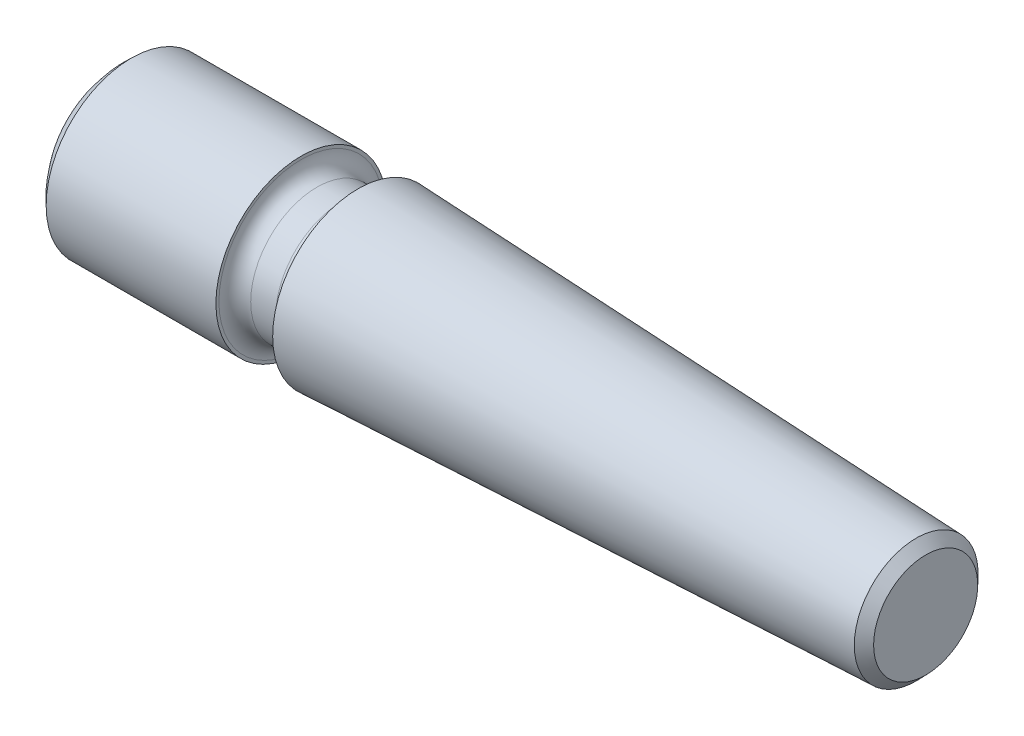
from build123d import *


with BuildPart() as part:
    # Sketch1 → Revolve1 (revolve)
    with BuildSketch(Plane.XY, mode=Mode.PRIVATE) as revolve1_sk:
        with BuildLine():
            Line((0, 0), (0, 2.75))
            Line((0, 2.75), (-0.499566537, 3.270815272))
            Line((-0.499566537, 3.270815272), (-30, 4.5))
            Line((-30, 4.5), (-30, 4.34))
            ThreePointArc((-30, 4.34), (-30.246030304, 3.746030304), (-30.84, 3.5))
            Line((-30.84, 3.5), (-32.16, 3.5))
            ThreePointArc((-32.16, 3.5), (-32.753969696, 3.746030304), (-33, 4.34))
            Line((-33, 4.34), (-33, 4.5))
            Line((-33, 4.5), (-41.968626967, 4.5))
            ThreePointArc((-41.968626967, 4.5), (-43.468626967, 2.468626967), (-44, 0))
            Line((-44, 0), (0, 0))
        make_face()
    revolve(revolve1_sk.sketch.rotate(Axis((-44, 0, 0), (1, 0, 0)), 90), axis=Axis((-44, 0, 0), (1, 0, 0)))


solid = part.part
